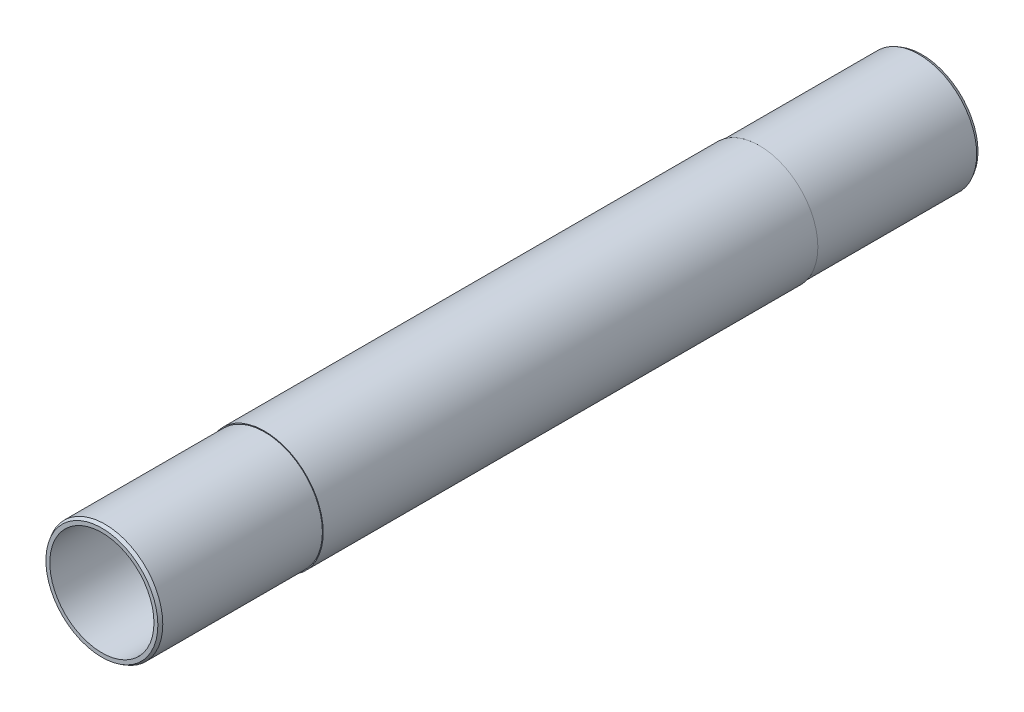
ISO-10303-21;
HEADER;
FILE_DESCRIPTION(('STEP AP214'),'2;1');
FILE_NAME('part.step','',(''),(''),'','','');
FILE_SCHEMA(('AUTOMOTIVE_DESIGN { 1 0 10303 214 1 1 1 1 }'));
ENDSEC;
DATA;
#1=APPLICATION_CONTEXT('core data for automotive mechanical design processes');
#2=APPLICATION_PROTOCOL_DEFINITION('international standard','automotive_design',2000,#1);
#3=PRODUCT_CONTEXT('',#1,'mechanical');
#4=PRODUCT('Part','Part','',(#3));
#5=PRODUCT_RELATED_PRODUCT_CATEGORY('part','',(#4));
#6=PRODUCT_DEFINITION_FORMATION('','',#4);
#7=PRODUCT_DEFINITION_CONTEXT('part definition',#1,'design');
#8=PRODUCT_DEFINITION('design','',#6,#7);
#9=PRODUCT_DEFINITION_SHAPE('','',#8);
#10=(LENGTH_UNIT() NAMED_UNIT(*) SI_UNIT(.MILLI.,.METRE.));
#11=(NAMED_UNIT(*) PLANE_ANGLE_UNIT() SI_UNIT($,.RADIAN.));
#12=(NAMED_UNIT(*) SI_UNIT($,.STERADIAN.) SOLID_ANGLE_UNIT());
#13=UNCERTAINTY_MEASURE_WITH_UNIT(LENGTH_MEASURE(1.E-05),#10,'distance_accuracy_value','');
#14=(GEOMETRIC_REPRESENTATION_CONTEXT(3) GLOBAL_UNCERTAINTY_ASSIGNED_CONTEXT((#13)) GLOBAL_UNIT_ASSIGNED_CONTEXT((#10,
#11,#12)) REPRESENTATION_CONTEXT('',''));
#15=CARTESIAN_POINT('',(0.,0.,0.));
#16=DIRECTION('',(0.,0.,1.));
#17=DIRECTION('',(1.,0.,0.));
#18=AXIS2_PLACEMENT_3D('',#15,#16,#17);
#19=CARTESIAN_POINT('',(0.,0.,200.));
#20=DIRECTION('',(0.,0.,-1.));
#21=DIRECTION('',(-1.,0.,0.));
#22=AXIS2_PLACEMENT_3D('',#19,#20,#21);
#23=CYLINDRICAL_SURFACE('',#22,28.1813);
#24=CARTESIAN_POINT('',(0.,0.,-198.476));
#25=DIRECTION('',(0.,0.,1.));
#26=DIRECTION('',(1.,0.,0.));
#27=AXIS2_PLACEMENT_3D('',#24,#25,#26);
#28=CIRCLE('',#27,28.1813);
#29=CARTESIAN_POINT('',(28.1813,0.,-198.476));
#30=VERTEX_POINT('',#29);
#31=EDGE_CURVE('E35',#30,#30,#28,.T.);
#32=ORIENTED_EDGE('',*,*,#31,.T.);
#33=EDGE_LOOP('',(#32));
#34=FACE_BOUND('',#33,.T.);
#35=CARTESIAN_POINT('',(0.,0.,-120.625));
#36=DIRECTION('',(0.,0.,1.));
#37=DIRECTION('',(1.,0.,0.));
#38=AXIS2_PLACEMENT_3D('',#35,#36,#37);
#39=CIRCLE('',#38,28.1813);
#40=CARTESIAN_POINT('',(28.1813,0.,-120.625));
#41=VERTEX_POINT('',#40);
#42=EDGE_CURVE('E9',#41,#41,#39,.T.);
#43=ORIENTED_EDGE('',*,*,#42,.F.);
#44=EDGE_LOOP('',(#43));
#45=FACE_BOUND('',#44,.T.);
#46=ADVANCED_FACE('F14',(#34,#45),#23,.T.);
#47=CARTESIAN_POINT('',(0.,0.,200.));
#48=DIRECTION('',(0.,0.,1.));
#49=DIRECTION('',(1.,0.,0.));
#50=AXIS2_PLACEMENT_3D('',#47,#48,#49);
#51=PLANE('',#50);
#52=CARTESIAN_POINT('',(0.,0.,200.));
#53=DIRECTION('',(0.,0.,1.));
#54=DIRECTION('',(1.,0.,0.));
#55=AXIS2_PLACEMENT_3D('',#52,#53,#54);
#56=CIRCLE('',#55,25.4);
#57=CARTESIAN_POINT('',(25.4,0.,200.));
#58=VERTEX_POINT('',#57);
#59=EDGE_CURVE('E61',#58,#58,#56,.T.);
#60=ORIENTED_EDGE('',*,*,#59,.F.);
#61=EDGE_LOOP('',(#60));
#62=FACE_BOUND('',#61,.T.);
#63=CARTESIAN_POINT('',(0.,0.,200.));
#64=DIRECTION('',(0.,0.,1.));
#65=DIRECTION('',(1.,0.,0.));
#66=AXIS2_PLACEMENT_3D('',#63,#64,#65);
#67=CIRCLE('',#66,27.3014181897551);
#68=CARTESIAN_POINT('',(27.3014181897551,0.,200.));
#69=VERTEX_POINT('',#68);
#70=EDGE_CURVE('E41',#69,#69,#67,.T.);
#71=ORIENTED_EDGE('',*,*,#70,.T.);
#72=EDGE_LOOP('',(#71));
#73=FACE_BOUND('',#72,.T.);
#74=ADVANCED_FACE('F73',(#62,#73),#51,.T.);
#75=CARTESIAN_POINT('',(0.,0.,-200.));
#76=DIRECTION('',(0.,0.,1.));
#77=DIRECTION('',(1.,0.,0.));
#78=AXIS2_PLACEMENT_3D('',#75,#76,#77);
#79=PLANE('',#78);
#80=CARTESIAN_POINT('',(0.,0.,-200.));
#81=DIRECTION('',(0.,0.,1.));
#82=DIRECTION('',(1.,0.,0.));
#83=AXIS2_PLACEMENT_3D('',#80,#81,#82);
#84=CIRCLE('',#83,25.4);
#85=CARTESIAN_POINT('',(25.4,0.,-200.));
#86=VERTEX_POINT('',#85);
#87=EDGE_CURVE('E57',#86,#86,#84,.T.);
#88=ORIENTED_EDGE('',*,*,#87,.T.);
#89=EDGE_LOOP('',(#88));
#90=FACE_BOUND('',#89,.T.);
#91=CARTESIAN_POINT('',(0.,0.,-200.));
#92=DIRECTION('',(0.,0.,1.));
#93=DIRECTION('',(1.,0.,0.));
#94=AXIS2_PLACEMENT_3D('',#91,#92,#93);
#95=CIRCLE('',#94,27.301418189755);
#96=CARTESIAN_POINT('',(27.301418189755,0.,-200.));
#97=VERTEX_POINT('',#96);
#98=EDGE_CURVE('E22',#97,#97,#95,.F.);
#99=ORIENTED_EDGE('',*,*,#98,.T.);
#100=EDGE_LOOP('',(#99));
#101=FACE_BOUND('',#100,.T.);
#102=ADVANCED_FACE('F76',(#90,#101),#79,.F.);
#103=CARTESIAN_POINT('',(0.,0.,120.625));
#104=DIRECTION('',(0.,0.,1.));
#105=DIRECTION('',(1.,0.,0.));
#106=AXIS2_PLACEMENT_3D('',#103,#104,#105);
#107=CIRCLE('',#106,28.1813);
#108=CARTESIAN_POINT('',(28.1813,0.,120.625));
#109=VERTEX_POINT('',#108);
#110=EDGE_CURVE('E50',#109,#109,#107,.T.);
#111=ORIENTED_EDGE('',*,*,#110,.T.);
#112=EDGE_LOOP('',(#111));
#113=FACE_BOUND('',#112,.T.);
#114=CARTESIAN_POINT('',(0.,0.,198.476));
#115=DIRECTION('',(0.,0.,1.));
#116=DIRECTION('',(1.,0.,0.));
#117=AXIS2_PLACEMENT_3D('',#114,#115,#116);
#118=CIRCLE('',#117,28.1813);
#119=CARTESIAN_POINT('',(28.1813,0.,198.476));
#120=VERTEX_POINT('',#119);
#121=EDGE_CURVE('E29',#120,#120,#118,.F.);
#122=ORIENTED_EDGE('',*,*,#121,.T.);
#123=EDGE_LOOP('',(#122));
#124=FACE_BOUND('',#123,.T.);
#125=ADVANCED_FACE('F82',(#113,#124),#23,.T.);
#126=CARTESIAN_POINT('',(0.,0.,200.));
#127=DIRECTION('',(0.,0.,-1.));
#128=DIRECTION('',(-1.,0.,0.));
#129=AXIS2_PLACEMENT_3D('',#126,#127,#128);
#130=CONICAL_SURFACE('',#129,27.3014181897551,0.523598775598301);
#131=ORIENTED_EDGE('',*,*,#121,.F.);
#132=EDGE_LOOP('',(#131));
#133=FACE_BOUND('',#132,.T.);
#134=ORIENTED_EDGE('',*,*,#70,.F.);
#135=EDGE_LOOP('',(#134));
#136=FACE_BOUND('',#135,.T.);
#137=ADVANCED_FACE('F80',(#133,#136),#130,.T.);
#138=CARTESIAN_POINT('',(0.,0.,-198.476));
#139=DIRECTION('',(0.,0.,1.));
#140=DIRECTION('',(1.,0.,0.));
#141=AXIS2_PLACEMENT_3D('',#138,#139,#140);
#142=CONICAL_SURFACE('',#141,28.1813,0.523598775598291);
#143=ORIENTED_EDGE('',*,*,#98,.F.);
#144=EDGE_LOOP('',(#143));
#145=FACE_BOUND('',#144,.T.);
#146=ORIENTED_EDGE('',*,*,#31,.F.);
#147=EDGE_LOOP('',(#146));
#148=FACE_BOUND('',#147,.T.);
#149=ADVANCED_FACE('F16',(#145,#148),#142,.T.);
#150=CARTESIAN_POINT('',(0.,0.,120.625));
#151=DIRECTION('',(0.,0.,1.));
#152=DIRECTION('',(1.,0.,0.));
#153=AXIS2_PLACEMENT_3D('',#150,#151,#152);
#154=PLANE('',#153);
#155=CARTESIAN_POINT('',(0.,0.,120.625));
#156=DIRECTION('',(0.,0.,1.));
#157=DIRECTION('',(1.,0.,0.));
#158=AXIS2_PLACEMENT_3D('',#155,#156,#157);
#159=CIRCLE('',#158,28.575);
#160=CARTESIAN_POINT('',(28.575,0.,120.625));
#161=VERTEX_POINT('',#160);
#162=EDGE_CURVE('E45',#161,#161,#159,.T.);
#163=ORIENTED_EDGE('',*,*,#162,.T.);
#164=EDGE_LOOP('',(#163));
#165=FACE_BOUND('',#164,.T.);
#166=ORIENTED_EDGE('',*,*,#110,.F.);
#167=EDGE_LOOP('',(#166));
#168=FACE_BOUND('',#167,.T.);
#169=ADVANCED_FACE('F89',(#165,#168),#154,.T.);
#170=CARTESIAN_POINT('',(0.,0.,-120.625));
#171=DIRECTION('',(0.,0.,1.));
#172=DIRECTION('',(1.,0.,0.));
#173=AXIS2_PLACEMENT_3D('',#170,#171,#172);
#174=PLANE('',#173);
#175=CARTESIAN_POINT('',(0.,0.,-120.625));
#176=DIRECTION('',(0.,0.,1.));
#177=DIRECTION('',(1.,0.,0.));
#178=AXIS2_PLACEMENT_3D('',#175,#176,#177);
#179=CIRCLE('',#178,28.575);
#180=CARTESIAN_POINT('',(28.575,0.,-120.625));
#181=VERTEX_POINT('',#180);
#182=EDGE_CURVE('E46',#181,#181,#179,.T.);
#183=ORIENTED_EDGE('',*,*,#182,.F.);
#184=EDGE_LOOP('',(#183));
#185=FACE_BOUND('',#184,.T.);
#186=ORIENTED_EDGE('',*,*,#42,.T.);
#187=EDGE_LOOP('',(#186));
#188=FACE_BOUND('',#187,.T.);
#189=ADVANCED_FACE('F106',(#185,#188),#174,.F.);
#190=CARTESIAN_POINT('',(0.,0.,120.625));
#191=DIRECTION('',(0.,0.,-1.));
#192=DIRECTION('',(-1.,0.,0.));
#193=AXIS2_PLACEMENT_3D('',#190,#191,#192);
#194=CYLINDRICAL_SURFACE('',#193,28.575);
#195=ORIENTED_EDGE('',*,*,#162,.F.);
#196=EDGE_LOOP('',(#195));
#197=FACE_BOUND('',#196,.T.);
#198=ORIENTED_EDGE('',*,*,#182,.T.);
#199=EDGE_LOOP('',(#198));
#200=FACE_BOUND('',#199,.T.);
#201=ADVANCED_FACE('F103',(#197,#200),#194,.T.);
#202=CARTESIAN_POINT('',(0.,0.,200.));
#203=DIRECTION('',(0.,0.,-1.));
#204=DIRECTION('',(-1.,0.,0.));
#205=AXIS2_PLACEMENT_3D('',#202,#203,#204);
#206=CYLINDRICAL_SURFACE('',#205,25.4);
#207=ORIENTED_EDGE('',*,*,#59,.T.);
#208=EDGE_LOOP('',(#207));
#209=FACE_BOUND('',#208,.T.);
#210=ORIENTED_EDGE('',*,*,#87,.F.);
#211=EDGE_LOOP('',(#210));
#212=FACE_BOUND('',#211,.T.);
#213=ADVANCED_FACE('F70',(#209,#212),#206,.F.);
#214=CLOSED_SHELL('',(#46,#74,#102,#125,#137,#149,#169,#189,#201,#213));
#215=MANIFOLD_SOLID_BREP('B1',#214);
#216=ADVANCED_BREP_SHAPE_REPRESENTATION('',(#18,#215),#14);
#217=SHAPE_DEFINITION_REPRESENTATION(#9,#216);
ENDSEC;
END-ISO-10303-21;
